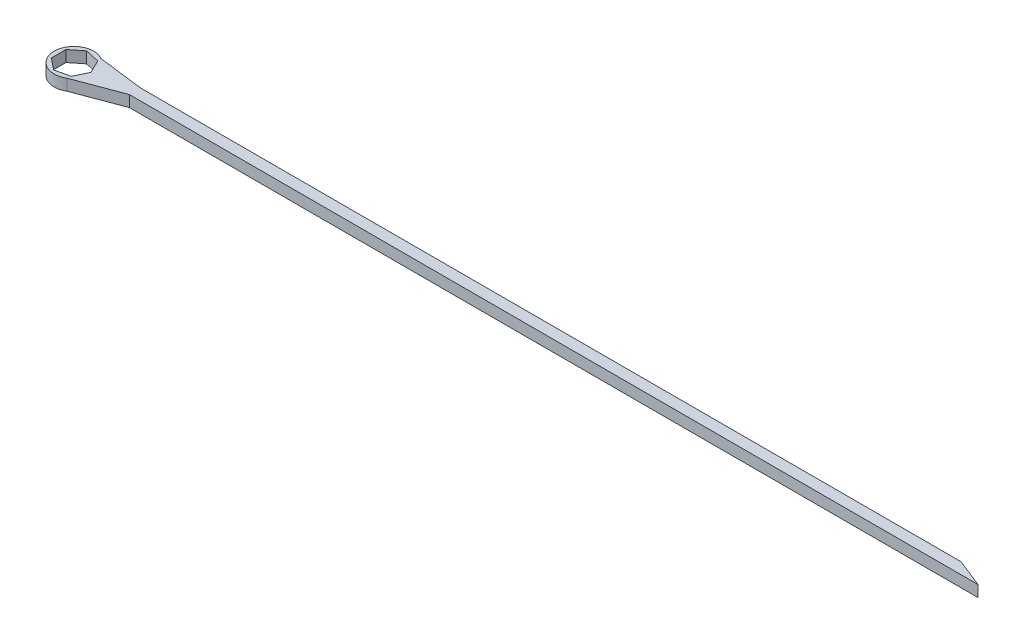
ISO-10303-21;
HEADER;
FILE_DESCRIPTION(('STEP AP214'),'2;1');
FILE_NAME('part.step','',(''),(''),'','','');
FILE_SCHEMA(('AUTOMOTIVE_DESIGN { 1 0 10303 214 1 1 1 1 }'));
ENDSEC;
DATA;
#1=APPLICATION_CONTEXT('core data for automotive mechanical design processes');
#2=APPLICATION_PROTOCOL_DEFINITION('international standard','automotive_design',2000,#1);
#3=PRODUCT_CONTEXT('',#1,'mechanical');
#4=PRODUCT('Part','Part','',(#3));
#5=PRODUCT_RELATED_PRODUCT_CATEGORY('part','',(#4));
#6=PRODUCT_DEFINITION_FORMATION('','',#4);
#7=PRODUCT_DEFINITION_CONTEXT('part definition',#1,'design');
#8=PRODUCT_DEFINITION('design','',#6,#7);
#9=PRODUCT_DEFINITION_SHAPE('','',#8);
#10=(LENGTH_UNIT() NAMED_UNIT(*) SI_UNIT(.MILLI.,.METRE.));
#11=(NAMED_UNIT(*) PLANE_ANGLE_UNIT() SI_UNIT($,.RADIAN.));
#12=(NAMED_UNIT(*) SI_UNIT($,.STERADIAN.) SOLID_ANGLE_UNIT());
#13=UNCERTAINTY_MEASURE_WITH_UNIT(LENGTH_MEASURE(1.E-05),#10,'distance_accuracy_value','');
#14=(GEOMETRIC_REPRESENTATION_CONTEXT(3) GLOBAL_UNCERTAINTY_ASSIGNED_CONTEXT((#13)) GLOBAL_UNIT_ASSIGNED_CONTEXT((#10,
#11,#12)) REPRESENTATION_CONTEXT('',''));
#15=CARTESIAN_POINT('',(0.,0.,0.));
#16=DIRECTION('',(0.,0.,1.));
#17=DIRECTION('',(1.,0.,0.));
#18=AXIS2_PLACEMENT_3D('',#15,#16,#17);
#19=CARTESIAN_POINT('',(0.,1.,0.));
#20=DIRECTION('',(0.,1.,0.));
#21=DIRECTION('',(0.,0.,1.));
#22=AXIS2_PLACEMENT_3D('',#19,#20,#21);
#23=PLANE('',#22);
#24=DIRECTION('',(0.936329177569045,0.,-0.351123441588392));
#25=VECTOR('',#24,1.);
#26=CARTESIAN_POINT('',(4.901387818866,1.,0.));
#27=LINE('',#26,#25);
#28=CARTESIAN_POINT('',(0.901387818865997,1.,1.5));
#29=VERTEX_POINT('',#28);
#30=CARTESIAN_POINT('',(4.901387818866,1.,0.));
#31=VERTEX_POINT('',#30);
#32=EDGE_CURVE('E185',#29,#31,#27,.T.);
#33=ORIENTED_EDGE('',*,*,#32,.T.);
#34=DIRECTION('',(1.,0.,0.));
#35=VECTOR('',#34,1.);
#36=CARTESIAN_POINT('',(4.901387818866,1.,0.));
#37=LINE('',#36,#35);
#38=CARTESIAN_POINT('',(80.,1.,0.));
#39=VERTEX_POINT('',#38);
#40=EDGE_CURVE('E188',#31,#39,#37,.T.);
#41=ORIENTED_EDGE('',*,*,#40,.T.);
#42=DIRECTION('',(-0.928476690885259,0.,-0.371390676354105));
#43=VECTOR('',#42,1.);
#44=CARTESIAN_POINT('',(80.,1.,0.));
#45=LINE('',#44,#43);
#46=CARTESIAN_POINT('',(77.5,1.,-1.00000000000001));
#47=VERTEX_POINT('',#46);
#48=EDGE_CURVE('E191',#39,#47,#45,.T.);
#49=ORIENTED_EDGE('',*,*,#48,.T.);
#50=DIRECTION('',(-1.,0.,0.));
#51=VECTOR('',#50,1.);
#52=CARTESIAN_POINT('',(77.5,1.,-1.00000000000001));
#53=LINE('',#52,#51);
#54=CARTESIAN_POINT('',(4.901387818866,1.,-0.999999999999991));
#55=VERTEX_POINT('',#54);
#56=EDGE_CURVE('E193',#47,#55,#53,.T.);
#57=ORIENTED_EDGE('',*,*,#56,.T.);
#58=DIRECTION('',(-0.992277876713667,0.,-0.124034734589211));
#59=VECTOR('',#58,1.);
#60=CARTESIAN_POINT('',(4.901387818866,1.,-0.999999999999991));
#61=LINE('',#60,#59);
#62=CARTESIAN_POINT('',(0.901387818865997,1.,-1.5));
#63=VERTEX_POINT('',#62);
#64=EDGE_CURVE('E195',#55,#63,#61,.T.);
#65=ORIENTED_EDGE('',*,*,#64,.T.);
#66=CARTESIAN_POINT('',(0.,1.,0.));
#67=DIRECTION('',(0.,1.,0.));
#68=DIRECTION('',(0.,0.,1.));
#69=AXIS2_PLACEMENT_3D('',#66,#67,#68);
#70=CIRCLE('',#69,1.75);
#71=EDGE_CURVE('E197',#63,#29,#70,.T.);
#72=ORIENTED_EDGE('',*,*,#71,.T.);
#73=EDGE_LOOP('',(#33,#41,#49,#57,#65,#72));
#74=FACE_BOUND('',#73,.T.);
#75=DIRECTION('',(-0.433883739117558,0.,-0.900968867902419));
#76=VECTOR('',#75,1.);
#77=CARTESIAN_POINT('',(1.5,1.,0.));
#78=LINE('',#77,#76);
#79=CARTESIAN_POINT('',(1.5,1.,0.));
#80=VERTEX_POINT('',#79);
#81=CARTESIAN_POINT('',(0.9352347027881,1.,-1.17274722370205));
#82=VERTEX_POINT('',#81);
#83=EDGE_CURVE('E135',#80,#82,#78,.T.);
#84=ORIENTED_EDGE('',*,*,#83,.F.);
#85=DIRECTION('',(0.433883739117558,0.,-0.900968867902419));
#86=VECTOR('',#85,1.);
#87=CARTESIAN_POINT('',(0.9352347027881,1.,1.17274722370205));
#88=LINE('',#87,#86);
#89=CARTESIAN_POINT('',(0.9352347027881,1.,1.17274722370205));
#90=VERTEX_POINT('',#89);
#91=EDGE_CURVE('E127',#90,#80,#88,.T.);
#92=ORIENTED_EDGE('',*,*,#91,.F.);
#93=DIRECTION('',(0.974927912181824,0.,-0.222520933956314));
#94=VECTOR('',#93,1.);
#95=CARTESIAN_POINT('',(-0.333781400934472,1.,1.46239186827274));
#96=LINE('',#95,#94);
#97=CARTESIAN_POINT('',(-0.333781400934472,1.,1.46239186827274));
#98=VERTEX_POINT('',#97);
#99=EDGE_CURVE('E158',#98,#90,#96,.T.);
#100=ORIENTED_EDGE('',*,*,#99,.F.);
#101=DIRECTION('',(0.78183148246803,0.,0.623489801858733));
#102=VECTOR('',#101,1.);
#103=CARTESIAN_POINT('',(-1.35145330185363,1.,0.650825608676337));
#104=LINE('',#103,#102);
#105=CARTESIAN_POINT('',(-1.35145330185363,1.,0.650825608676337));
#106=VERTEX_POINT('',#105);
#107=EDGE_CURVE('E156',#106,#98,#104,.T.);
#108=ORIENTED_EDGE('',*,*,#107,.F.);
#109=DIRECTION('',(0.,0.,1.));
#110=VECTOR('',#109,1.);
#111=CARTESIAN_POINT('',(-1.35145330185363,1.,-0.650825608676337));
#112=LINE('',#111,#110);
#113=CARTESIAN_POINT('',(-1.35145330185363,1.,-0.650825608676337));
#114=VERTEX_POINT('',#113);
#115=EDGE_CURVE('E154',#114,#106,#112,.T.);
#116=ORIENTED_EDGE('',*,*,#115,.F.);
#117=DIRECTION('',(-0.78183148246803,0.,0.623489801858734));
#118=VECTOR('',#117,1.);
#119=CARTESIAN_POINT('',(-0.333781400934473,1.,-1.46239186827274));
#120=LINE('',#119,#118);
#121=CARTESIAN_POINT('',(-0.333781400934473,1.,-1.46239186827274));
#122=VERTEX_POINT('',#121);
#123=EDGE_CURVE('E150',#122,#114,#120,.T.);
#124=ORIENTED_EDGE('',*,*,#123,.F.);
#125=DIRECTION('',(-0.974927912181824,0.,-0.222520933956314));
#126=VECTOR('',#125,1.);
#127=CARTESIAN_POINT('',(0.9352347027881,1.,-1.17274722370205));
#128=LINE('',#127,#126);
#129=EDGE_CURVE('E148',#82,#122,#128,.T.);
#130=ORIENTED_EDGE('',*,*,#129,.F.);
#131=EDGE_LOOP('',(#84,#92,#100,#108,#116,#124,#130));
#132=FACE_BOUND('',#131,.T.);
#133=ADVANCED_FACE('F32',(#74,#132),#23,.T.);
#134=CARTESIAN_POINT('',(0.,0.,0.));
#135=DIRECTION('',(0.,1.,0.));
#136=DIRECTION('',(0.,0.,1.));
#137=AXIS2_PLACEMENT_3D('',#134,#135,#136);
#138=PLANE('',#137);
#139=DIRECTION('',(0.936329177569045,0.,-0.351123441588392));
#140=VECTOR('',#139,1.);
#141=CARTESIAN_POINT('',(4.901387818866,0.,0.));
#142=LINE('',#141,#140);
#143=CARTESIAN_POINT('',(0.901387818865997,0.,1.5));
#144=VERTEX_POINT('',#143);
#145=CARTESIAN_POINT('',(4.901387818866,0.,0.));
#146=VERTEX_POINT('',#145);
#147=EDGE_CURVE('E143',#144,#146,#142,.T.);
#148=ORIENTED_EDGE('',*,*,#147,.F.);
#149=CARTESIAN_POINT('',(0.,0.,0.));
#150=DIRECTION('',(0.,1.,0.));
#151=DIRECTION('',(0.,0.,1.));
#152=AXIS2_PLACEMENT_3D('',#149,#150,#151);
#153=CIRCLE('',#152,1.75);
#154=CARTESIAN_POINT('',(0.901387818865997,0.,-1.5));
#155=VERTEX_POINT('',#154);
#156=EDGE_CURVE('E189',#155,#144,#153,.T.);
#157=ORIENTED_EDGE('',*,*,#156,.F.);
#158=DIRECTION('',(-0.992277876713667,0.,-0.124034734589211));
#159=VECTOR('',#158,1.);
#160=CARTESIAN_POINT('',(4.901387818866,0.,-0.999999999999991));
#161=LINE('',#160,#159);
#162=CARTESIAN_POINT('',(4.901387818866,0.,-0.999999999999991));
#163=VERTEX_POINT('',#162);
#164=EDGE_CURVE('E208',#163,#155,#161,.T.);
#165=ORIENTED_EDGE('',*,*,#164,.F.);
#166=DIRECTION('',(-1.,0.,0.));
#167=VECTOR('',#166,1.);
#168=CARTESIAN_POINT('',(77.5,0.,-1.00000000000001));
#169=LINE('',#168,#167);
#170=CARTESIAN_POINT('',(77.5,0.,-1.00000000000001));
#171=VERTEX_POINT('',#170);
#172=EDGE_CURVE('E206',#171,#163,#169,.T.);
#173=ORIENTED_EDGE('',*,*,#172,.F.);
#174=DIRECTION('',(-0.928476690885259,0.,-0.371390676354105));
#175=VECTOR('',#174,1.);
#176=CARTESIAN_POINT('',(80.,0.,0.));
#177=LINE('',#176,#175);
#178=CARTESIAN_POINT('',(80.,0.,0.));
#179=VERTEX_POINT('',#178);
#180=EDGE_CURVE('E204',#179,#171,#177,.T.);
#181=ORIENTED_EDGE('',*,*,#180,.F.);
#182=DIRECTION('',(1.,0.,0.));
#183=VECTOR('',#182,1.);
#184=CARTESIAN_POINT('',(4.901387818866,0.,0.));
#185=LINE('',#184,#183);
#186=EDGE_CURVE('E202',#146,#179,#185,.T.);
#187=ORIENTED_EDGE('',*,*,#186,.F.);
#188=EDGE_LOOP('',(#148,#157,#165,#173,#181,#187));
#189=FACE_BOUND('',#188,.T.);
#190=DIRECTION('',(0.433883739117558,0.,-0.900968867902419));
#191=VECTOR('',#190,1.);
#192=CARTESIAN_POINT('',(0.9352347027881,0.,1.17274722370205));
#193=LINE('',#192,#191);
#194=CARTESIAN_POINT('',(0.9352347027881,0.,1.17274722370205));
#195=VERTEX_POINT('',#194);
#196=CARTESIAN_POINT('',(1.5,0.,0.));
#197=VERTEX_POINT('',#196);
#198=EDGE_CURVE('E55',#195,#197,#193,.T.);
#199=ORIENTED_EDGE('',*,*,#198,.T.);
#200=DIRECTION('',(-0.433883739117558,0.,-0.900968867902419));
#201=VECTOR('',#200,1.);
#202=CARTESIAN_POINT('',(1.5,0.,0.));
#203=LINE('',#202,#201);
#204=CARTESIAN_POINT('',(0.9352347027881,0.,-1.17274722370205));
#205=VERTEX_POINT('',#204);
#206=EDGE_CURVE('E142',#197,#205,#203,.T.);
#207=ORIENTED_EDGE('',*,*,#206,.T.);
#208=DIRECTION('',(-0.974927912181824,0.,-0.222520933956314));
#209=VECTOR('',#208,1.);
#210=CARTESIAN_POINT('',(0.9352347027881,0.,-1.17274722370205));
#211=LINE('',#210,#209);
#212=CARTESIAN_POINT('',(-0.333781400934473,0.,-1.46239186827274));
#213=VERTEX_POINT('',#212);
#214=EDGE_CURVE('E162',#205,#213,#211,.T.);
#215=ORIENTED_EDGE('',*,*,#214,.T.);
#216=DIRECTION('',(-0.78183148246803,0.,0.623489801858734));
#217=VECTOR('',#216,1.);
#218=CARTESIAN_POINT('',(-0.333781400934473,0.,-1.46239186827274));
#219=LINE('',#218,#217);
#220=CARTESIAN_POINT('',(-1.35145330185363,0.,-0.650825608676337));
#221=VERTEX_POINT('',#220);
#222=EDGE_CURVE('E165',#213,#221,#219,.T.);
#223=ORIENTED_EDGE('',*,*,#222,.T.);
#224=DIRECTION('',(0.,0.,1.));
#225=VECTOR('',#224,1.);
#226=CARTESIAN_POINT('',(-1.35145330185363,0.,-0.650825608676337));
#227=LINE('',#226,#225);
#228=CARTESIAN_POINT('',(-1.35145330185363,0.,0.650825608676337));
#229=VERTEX_POINT('',#228);
#230=EDGE_CURVE('E168',#221,#229,#227,.T.);
#231=ORIENTED_EDGE('',*,*,#230,.T.);
#232=DIRECTION('',(0.78183148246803,0.,0.623489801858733));
#233=VECTOR('',#232,1.);
#234=CARTESIAN_POINT('',(-1.35145330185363,0.,0.650825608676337));
#235=LINE('',#234,#233);
#236=CARTESIAN_POINT('',(-0.333781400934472,0.,1.46239186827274));
#237=VERTEX_POINT('',#236);
#238=EDGE_CURVE('E171',#229,#237,#235,.T.);
#239=ORIENTED_EDGE('',*,*,#238,.T.);
#240=DIRECTION('',(0.974927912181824,0.,-0.222520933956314));
#241=VECTOR('',#240,1.);
#242=CARTESIAN_POINT('',(-0.333781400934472,0.,1.46239186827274));
#243=LINE('',#242,#241);
#244=EDGE_CURVE('E136',#237,#195,#243,.T.);
#245=ORIENTED_EDGE('',*,*,#244,.T.);
#246=EDGE_LOOP('',(#199,#207,#215,#223,#231,#239,#245));
#247=FACE_BOUND('',#246,.T.);
#248=ADVANCED_FACE('F232',(#189,#247),#138,.F.);
#249=CARTESIAN_POINT('',(4.901387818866,1.,0.));
#250=DIRECTION('',(-0.351123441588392,0.,-0.936329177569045));
#251=DIRECTION('',(-0.936329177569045,0.,0.351123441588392));
#252=AXIS2_PLACEMENT_3D('',#249,#250,#251);
#253=PLANE('',#252);
#254=ORIENTED_EDGE('',*,*,#147,.T.);
#255=DIRECTION('',(0.,-1.,0.));
#256=VECTOR('',#255,1.);
#257=CARTESIAN_POINT('',(4.901387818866,1.,0.));
#258=LINE('',#257,#256);
#259=EDGE_CURVE('E11',#31,#146,#258,.T.);
#260=ORIENTED_EDGE('',*,*,#259,.F.);
#261=ORIENTED_EDGE('',*,*,#32,.F.);
#262=DIRECTION('',(0.,-1.,0.));
#263=VECTOR('',#262,1.);
#264=CARTESIAN_POINT('',(0.901387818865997,1.,1.5));
#265=LINE('',#264,#263);
#266=EDGE_CURVE('E199',#29,#144,#265,.T.);
#267=ORIENTED_EDGE('',*,*,#266,.T.);
#268=EDGE_LOOP('',(#254,#260,#261,#267));
#269=FACE_BOUND('',#268,.T.);
#270=ADVANCED_FACE('F34',(#269),#253,.F.);
#271=CARTESIAN_POINT('',(4.901387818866,1.,0.));
#272=DIRECTION('',(0.,0.,-1.));
#273=DIRECTION('',(-1.,0.,0.));
#274=AXIS2_PLACEMENT_3D('',#271,#272,#273);
#275=PLANE('',#274);
#276=ORIENTED_EDGE('',*,*,#186,.T.);
#277=DIRECTION('',(0.,-1.,0.));
#278=VECTOR('',#277,1.);
#279=CARTESIAN_POINT('',(80.,1.,0.));
#280=LINE('',#279,#278);
#281=EDGE_CURVE('E40',#39,#179,#280,.T.);
#282=ORIENTED_EDGE('',*,*,#281,.F.);
#283=ORIENTED_EDGE('',*,*,#40,.F.);
#284=ORIENTED_EDGE('',*,*,#259,.T.);
#285=EDGE_LOOP('',(#276,#282,#283,#284));
#286=FACE_BOUND('',#285,.T.);
#287=ADVANCED_FACE('F249',(#286),#275,.F.);
#288=CARTESIAN_POINT('',(80.,1.,0.));
#289=DIRECTION('',(-0.371390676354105,0.,0.928476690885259));
#290=DIRECTION('',(0.928476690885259,0.,0.371390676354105));
#291=AXIS2_PLACEMENT_3D('',#288,#289,#290);
#292=PLANE('',#291);
#293=ORIENTED_EDGE('',*,*,#180,.T.);
#294=DIRECTION('',(0.,-1.,0.));
#295=VECTOR('',#294,1.);
#296=CARTESIAN_POINT('',(77.5,1.,-1.00000000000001));
#297=LINE('',#296,#295);
#298=EDGE_CURVE('E219',#47,#171,#297,.T.);
#299=ORIENTED_EDGE('',*,*,#298,.F.);
#300=ORIENTED_EDGE('',*,*,#48,.F.);
#301=ORIENTED_EDGE('',*,*,#281,.T.);
#302=EDGE_LOOP('',(#293,#299,#300,#301));
#303=FACE_BOUND('',#302,.T.);
#304=ADVANCED_FACE('F226',(#303),#292,.F.);
#305=CARTESIAN_POINT('',(77.5,1.,-1.00000000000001));
#306=DIRECTION('',(0.,0.,1.));
#307=DIRECTION('',(1.,0.,0.));
#308=AXIS2_PLACEMENT_3D('',#305,#306,#307);
#309=PLANE('',#308);
#310=ORIENTED_EDGE('',*,*,#172,.T.);
#311=DIRECTION('',(0.,-1.,0.));
#312=VECTOR('',#311,1.);
#313=CARTESIAN_POINT('',(4.901387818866,1.,-0.999999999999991));
#314=LINE('',#313,#312);
#315=EDGE_CURVE('E216',#55,#163,#314,.T.);
#316=ORIENTED_EDGE('',*,*,#315,.F.);
#317=ORIENTED_EDGE('',*,*,#56,.F.);
#318=ORIENTED_EDGE('',*,*,#298,.T.);
#319=EDGE_LOOP('',(#310,#316,#317,#318));
#320=FACE_BOUND('',#319,.T.);
#321=ADVANCED_FACE('F238',(#320),#309,.F.);
#322=CARTESIAN_POINT('',(4.901387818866,1.,-0.999999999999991));
#323=DIRECTION('',(-0.124034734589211,0.,0.992277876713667));
#324=DIRECTION('',(0.992277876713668,0.,0.124034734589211));
#325=AXIS2_PLACEMENT_3D('',#322,#323,#324);
#326=PLANE('',#325);
#327=ORIENTED_EDGE('',*,*,#164,.T.);
#328=DIRECTION('',(0.,-1.,0.));
#329=VECTOR('',#328,1.);
#330=CARTESIAN_POINT('',(0.901387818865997,1.,-1.5));
#331=LINE('',#330,#329);
#332=EDGE_CURVE('E213',#63,#155,#331,.T.);
#333=ORIENTED_EDGE('',*,*,#332,.F.);
#334=ORIENTED_EDGE('',*,*,#64,.F.);
#335=ORIENTED_EDGE('',*,*,#315,.T.);
#336=EDGE_LOOP('',(#327,#333,#334,#335));
#337=FACE_BOUND('',#336,.T.);
#338=ADVANCED_FACE('F242',(#337),#326,.F.);
#339=CARTESIAN_POINT('',(0.,1.,0.));
#340=DIRECTION('',(0.,-1.,0.));
#341=DIRECTION('',(0.,0.,-1.));
#342=AXIS2_PLACEMENT_3D('',#339,#340,#341);
#343=CYLINDRICAL_SURFACE('',#342,1.75);
#344=ORIENTED_EDGE('',*,*,#156,.T.);
#345=ORIENTED_EDGE('',*,*,#266,.F.);
#346=ORIENTED_EDGE('',*,*,#71,.F.);
#347=ORIENTED_EDGE('',*,*,#332,.T.);
#348=EDGE_LOOP('',(#344,#345,#346,#347));
#349=FACE_BOUND('',#348,.T.);
#350=ADVANCED_FACE('F252',(#349),#343,.T.);
#351=CARTESIAN_POINT('',(0.9352347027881,1.,1.17274722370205));
#352=DIRECTION('',(-0.900968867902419,0.,-0.433883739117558));
#353=DIRECTION('',(-0.433883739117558,0.,0.900968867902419));
#354=AXIS2_PLACEMENT_3D('',#351,#352,#353);
#355=PLANE('',#354);
#356=ORIENTED_EDGE('',*,*,#198,.F.);
#357=DIRECTION('',(0.,-1.,0.));
#358=VECTOR('',#357,1.);
#359=CARTESIAN_POINT('',(0.9352347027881,1.,1.17274722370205));
#360=LINE('',#359,#358);
#361=EDGE_CURVE('E131',#90,#195,#360,.T.);
#362=ORIENTED_EDGE('',*,*,#361,.F.);
#363=ORIENTED_EDGE('',*,*,#91,.T.);
#364=DIRECTION('',(0.,-1.,0.));
#365=VECTOR('',#364,1.);
#366=CARTESIAN_POINT('',(1.5,1.,0.));
#367=LINE('',#366,#365);
#368=EDGE_CURVE('E130',#80,#197,#367,.T.);
#369=ORIENTED_EDGE('',*,*,#368,.T.);
#370=EDGE_LOOP('',(#356,#362,#363,#369));
#371=FACE_BOUND('',#370,.T.);
#372=ADVANCED_FACE('F129',(#371),#355,.T.);
#373=CARTESIAN_POINT('',(1.5,1.,0.));
#374=DIRECTION('',(-0.900968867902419,0.,0.433883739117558));
#375=DIRECTION('',(0.433883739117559,0.,0.900968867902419));
#376=AXIS2_PLACEMENT_3D('',#373,#374,#375);
#377=PLANE('',#376);
#378=ORIENTED_EDGE('',*,*,#206,.F.);
#379=ORIENTED_EDGE('',*,*,#368,.F.);
#380=ORIENTED_EDGE('',*,*,#83,.T.);
#381=DIRECTION('',(0.,-1.,0.));
#382=VECTOR('',#381,1.);
#383=CARTESIAN_POINT('',(0.9352347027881,1.,-1.17274722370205));
#384=LINE('',#383,#382);
#385=EDGE_CURVE('E144',#82,#205,#384,.T.);
#386=ORIENTED_EDGE('',*,*,#385,.T.);
#387=EDGE_LOOP('',(#378,#379,#380,#386));
#388=FACE_BOUND('',#387,.T.);
#389=ADVANCED_FACE('F139',(#388),#377,.T.);
#390=CARTESIAN_POINT('',(0.9352347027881,1.,-1.17274722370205));
#391=DIRECTION('',(-0.222520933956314,0.,0.974927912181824));
#392=DIRECTION('',(0.974927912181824,0.,0.222520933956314));
#393=AXIS2_PLACEMENT_3D('',#390,#391,#392);
#394=PLANE('',#393);
#395=ORIENTED_EDGE('',*,*,#214,.F.);
#396=ORIENTED_EDGE('',*,*,#385,.F.);
#397=ORIENTED_EDGE('',*,*,#129,.T.);
#398=DIRECTION('',(0.,-1.,0.));
#399=VECTOR('',#398,1.);
#400=CARTESIAN_POINT('',(-0.333781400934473,1.,-1.46239186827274));
#401=LINE('',#400,#399);
#402=EDGE_CURVE('E182',#122,#213,#401,.T.);
#403=ORIENTED_EDGE('',*,*,#402,.T.);
#404=EDGE_LOOP('',(#395,#396,#397,#403));
#405=FACE_BOUND('',#404,.T.);
#406=ADVANCED_FACE('F270',(#405),#394,.T.);
#407=CARTESIAN_POINT('',(-0.333781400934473,1.,-1.46239186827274));
#408=DIRECTION('',(0.623489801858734,0.,0.78183148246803));
#409=DIRECTION('',(0.78183148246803,0.,-0.623489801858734));
#410=AXIS2_PLACEMENT_3D('',#407,#408,#409);
#411=PLANE('',#410);
#412=ORIENTED_EDGE('',*,*,#222,.F.);
#413=ORIENTED_EDGE('',*,*,#402,.F.);
#414=ORIENTED_EDGE('',*,*,#123,.T.);
#415=DIRECTION('',(0.,-1.,0.));
#416=VECTOR('',#415,1.);
#417=CARTESIAN_POINT('',(-1.35145330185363,1.,-0.650825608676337));
#418=LINE('',#417,#416);
#419=EDGE_CURVE('E180',#114,#221,#418,.T.);
#420=ORIENTED_EDGE('',*,*,#419,.T.);
#421=EDGE_LOOP('',(#412,#413,#414,#420));
#422=FACE_BOUND('',#421,.T.);
#423=ADVANCED_FACE('F273',(#422),#411,.T.);
#424=CARTESIAN_POINT('',(-1.35145330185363,1.,-0.650825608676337));
#425=DIRECTION('',(1.,0.,0.));
#426=DIRECTION('',(0.,0.,-1.));
#427=AXIS2_PLACEMENT_3D('',#424,#425,#426);
#428=PLANE('',#427);
#429=ORIENTED_EDGE('',*,*,#230,.F.);
#430=ORIENTED_EDGE('',*,*,#419,.F.);
#431=ORIENTED_EDGE('',*,*,#115,.T.);
#432=DIRECTION('',(0.,-1.,0.));
#433=VECTOR('',#432,1.);
#434=CARTESIAN_POINT('',(-1.35145330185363,1.,0.650825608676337));
#435=LINE('',#434,#433);
#436=EDGE_CURVE('E178',#106,#229,#435,.T.);
#437=ORIENTED_EDGE('',*,*,#436,.T.);
#438=EDGE_LOOP('',(#429,#430,#431,#437));
#439=FACE_BOUND('',#438,.T.);
#440=ADVANCED_FACE('F277',(#439),#428,.T.);
#441=CARTESIAN_POINT('',(-1.35145330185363,1.,0.650825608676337));
#442=DIRECTION('',(0.623489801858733,0.,-0.78183148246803));
#443=DIRECTION('',(-0.78183148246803,0.,-0.623489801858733));
#444=AXIS2_PLACEMENT_3D('',#441,#442,#443);
#445=PLANE('',#444);
#446=ORIENTED_EDGE('',*,*,#238,.F.);
#447=ORIENTED_EDGE('',*,*,#436,.F.);
#448=ORIENTED_EDGE('',*,*,#107,.T.);
#449=DIRECTION('',(0.,-1.,0.));
#450=VECTOR('',#449,1.);
#451=CARTESIAN_POINT('',(-0.333781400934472,1.,1.46239186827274));
#452=LINE('',#451,#450);
#453=EDGE_CURVE('E47',#98,#237,#452,.T.);
#454=ORIENTED_EDGE('',*,*,#453,.T.);
#455=EDGE_LOOP('',(#446,#447,#448,#454));
#456=FACE_BOUND('',#455,.T.);
#457=ADVANCED_FACE('F281',(#456),#445,.T.);
#458=CARTESIAN_POINT('',(-0.333781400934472,1.,1.46239186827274));
#459=DIRECTION('',(-0.222520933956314,0.,-0.974927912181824));
#460=DIRECTION('',(-0.974927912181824,0.,0.222520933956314));
#461=AXIS2_PLACEMENT_3D('',#458,#459,#460);
#462=PLANE('',#461);
#463=ORIENTED_EDGE('',*,*,#244,.F.);
#464=ORIENTED_EDGE('',*,*,#453,.F.);
#465=ORIENTED_EDGE('',*,*,#99,.T.);
#466=ORIENTED_EDGE('',*,*,#361,.T.);
#467=EDGE_LOOP('',(#463,#464,#465,#466));
#468=FACE_BOUND('',#467,.T.);
#469=ADVANCED_FACE('F285',(#468),#462,.T.);
#470=CLOSED_SHELL('',(#133,#248,#270,#287,#304,#321,#338,#350,#372,#389,#406,#423,#440,#457,#469));
#471=MANIFOLD_SOLID_BREP('B2',#470);
#472=ADVANCED_BREP_SHAPE_REPRESENTATION('',(#18,#471),#14);
#473=SHAPE_DEFINITION_REPRESENTATION(#9,#472);
ENDSEC;
END-ISO-10303-21;
